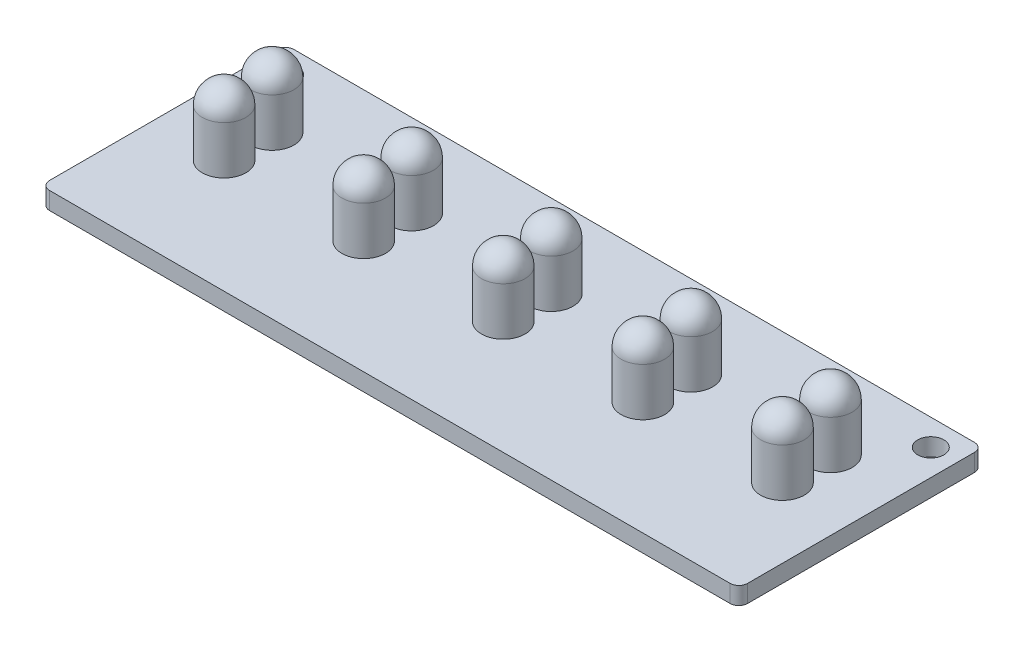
from build123d import *

# Parameters (mm, degrees)
SKETCH1_W           = 80
SKETCH1_H           = 28
BOSS_EXTRUDE1_DEPTH = 2
SKETCH2_R           = 1.5
CUT_EXTRUDE1_DEPTH  = 2
SKETCH3_W           = 20
SKETCH3_H           = 5
BOSS_EXTRUDE2_DEPTH = 6
LPATTERN2_COUNT     = 2
LPATTERN2_PITCH     = 5.5
LPATTERN3_COUNT     = 3
LPATTERN3_PITCH     = 16
LPATTERN3_COL_COUNT = 3
LPATTERN3_COL_PITCH = 16
FILLET1_R           = 1


with BuildPart() as part:
    # Sketch1 → Boss-Extrude1 (new body)
    with BuildSketch(Plane(origin=(0, 0, 0), x_dir=(1, 0, 0), z_dir=(0, 1, 0))):
        Rectangle(SKETCH1_W, SKETCH1_H)
    extrude(amount=BOSS_EXTRUDE1_DEPTH)

    # Sketch2 → Cut-Extrude1 (cut)
    with BuildSketch(Plane(origin=(0, 2, 0), x_dir=(1, 0, 0), z_dir=(0, 1, 0))):
        with Locations(Location((-37, 11, 0), (0, 0, 270))):
            Circle(SKETCH2_R)
        with Locations(Location((37, 11, 0), (0, 0, 90))):
            Circle(SKETCH2_R)
    extrude(amount=-CUT_EXTRUDE1_DEPTH, mode=Mode.SUBTRACT)

    # Sketch3 → Boss-Extrude2 (add)
    with BuildSketch(Plane(origin=(0, 0, 0), x_dir=(1, 0, 0), z_dir=(0, 1, 0))):
        with Locations((-5, 10)):
            Rectangle(SKETCH3_W, SKETCH3_H)
    extrude(amount=-BOSS_EXTRUDE2_DEPTH)

    # Sketch4 → Revolve1 (revolve)
    with BuildSketch(Plane(origin=(0, 0, 0), x_dir=(0, 0, -1), z_dir=(1, 0, 0))):
        with BuildLine():
            Line((-3.5, 2), (-3.5, 7.5))
            ThreePointArc((-3.5, 7.5), (-2.767766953, 9.267766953), (-1, 10))
            Line((-1, 10), (-1, 2))
            Line((-1, 2), (-3.5, 2))
        make_face()
    revolve1 = revolve(axis=Axis((0, 11.861403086, 1), (0, -1, 0)))

    # LPattern2: Revolve1 ×2
    with Locations(*[(0, 0, -i * LPATTERN2_PITCH) for i in range(1, LPATTERN2_COUNT)]):
        add(revolve1)

    # LPattern3: Revolve1 ×3
    with Locations(*[(i * LPATTERN3_PITCH, 0, 0) for i in range(1, LPATTERN3_COUNT)]):
        add(revolve1)

    # LPattern3 copy 1 sketch → LPattern3 copy 1 (revolve)
    with BuildSketch(Plane(origin=(16, 0, -5.5), x_dir=(0, 0, -1), z_dir=(1, 0, 0))):
        with BuildLine():
            Line((-3.5, 2), (-3.5, 7.5))
            ThreePointArc((-3.5, 7.5), (-2.767766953, 9.267766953), (-1, 10))
            Line((-1, 10), (-1, 2))
            Line((-1, 2), (-3.5, 2))
        make_face()
    revolve(axis=Axis((16, 11.861403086, -4.5), (0, -1, 0)))

    # LPattern3 copy 2 sketch → LPattern3 copy 2 (revolve)
    with BuildSketch(Plane(origin=(32, 0, -5.5), x_dir=(0, 0, -1), z_dir=(1, 0, 0))):
        with BuildLine():
            Line((-3.5, 2), (-3.5, 7.5))
            ThreePointArc((-3.5, 7.5), (-2.767766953, 9.267766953), (-1, 10))
            Line((-1, 10), (-1, 2))
            Line((-1, 2), (-3.5, 2))
        make_face()
    revolve(axis=Axis((32, 11.861403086, -4.5), (0, -1, 0)))

    # LPattern3 col: Revolve1 ×3
    with Locations(*[(-i * LPATTERN3_COL_PITCH, 0, 0) for i in range(1, LPATTERN3_COL_COUNT)]):
        add(revolve1)

    # LPattern3 col copy 1 sketch → LPattern3 col copy 1 (revolve)
    with BuildSketch(Plane(origin=(-16, 0, -5.5), x_dir=(0, 0, -1), z_dir=(1, 0, 0))):
        with BuildLine():
            Line((-3.5, 2), (-3.5, 7.5))
            ThreePointArc((-3.5, 7.5), (-2.767766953, 9.267766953), (-1, 10))
            Line((-1, 10), (-1, 2))
            Line((-1, 2), (-3.5, 2))
        make_face()
    revolve(axis=Axis((-16, 11.861403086, -4.5), (0, -1, 0)))

    # LPattern3 col copy 2 sketch → LPattern3 col copy 2 (revolve)
    with BuildSketch(Plane(origin=(-32, 0, -5.5), x_dir=(0, 0, -1), z_dir=(1, 0, 0))):
        with BuildLine():
            Line((-3.5, 2), (-3.5, 7.5))
            ThreePointArc((-3.5, 7.5), (-2.767766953, 9.267766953), (-1, 10))
            Line((-1, 10), (-1, 2))
            Line((-1, 2), (-3.5, 2))
        make_face()
    revolve(axis=Axis((-32, 11.861403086, -4.5), (0, -1, 0)))

    # Fillet1
    fillet1_edges = [part.edges().sort_by_distance(p)[0] for p in [
        (40, 1, 14),
        (-40, 1, 14),
        (-40, 1, -14),
        (40, 1, -14),
    ]]
    fillet(fillet1_edges, radius=FILLET1_R)


solid = part.part
